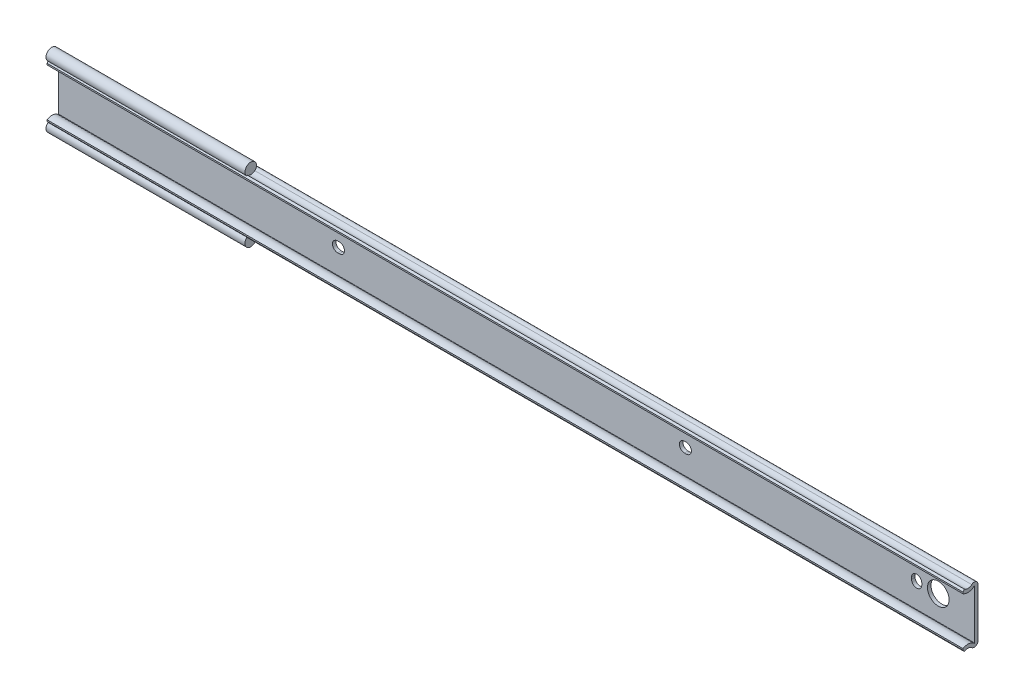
ISO-10303-21;
HEADER;
FILE_DESCRIPTION(('STEP AP214'),'2;1');
FILE_NAME('part.step','',(''),(''),'','','');
FILE_SCHEMA(('AUTOMOTIVE_DESIGN { 1 0 10303 214 1 1 1 1 }'));
ENDSEC;
DATA;
#1=APPLICATION_CONTEXT('core data for automotive mechanical design processes');
#2=APPLICATION_PROTOCOL_DEFINITION('international standard','automotive_design',2000,#1);
#3=PRODUCT_CONTEXT('',#1,'mechanical');
#4=PRODUCT('Part','Part','',(#3));
#5=PRODUCT_RELATED_PRODUCT_CATEGORY('part','',(#4));
#6=PRODUCT_DEFINITION_FORMATION('','',#4);
#7=PRODUCT_DEFINITION_CONTEXT('part definition',#1,'design');
#8=PRODUCT_DEFINITION('design','',#6,#7);
#9=PRODUCT_DEFINITION_SHAPE('','',#8);
#10=(LENGTH_UNIT() NAMED_UNIT(*) SI_UNIT(.MILLI.,.METRE.));
#11=(NAMED_UNIT(*) PLANE_ANGLE_UNIT() SI_UNIT($,.RADIAN.));
#12=(NAMED_UNIT(*) SI_UNIT($,.STERADIAN.) SOLID_ANGLE_UNIT());
#13=UNCERTAINTY_MEASURE_WITH_UNIT(LENGTH_MEASURE(1.E-05),#10,'distance_accuracy_value','');
#14=(GEOMETRIC_REPRESENTATION_CONTEXT(3) GLOBAL_UNCERTAINTY_ASSIGNED_CONTEXT((#13)) GLOBAL_UNIT_ASSIGNED_CONTEXT((#10,
#11,#12)) REPRESENTATION_CONTEXT('',''));
#15=CARTESIAN_POINT('',(0.,0.,0.));
#16=DIRECTION('',(0.,0.,1.));
#17=DIRECTION('',(1.,0.,0.));
#18=AXIS2_PLACEMENT_3D('',#15,#16,#17);
#19=CARTESIAN_POINT('',(-173.8,-13.9149976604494,4.44999754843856));
#20=DIRECTION('',(1.,0.,0.));
#21=DIRECTION('',(0.,0.,-1.));
#22=AXIS2_PLACEMENT_3D('',#19,#20,#21);
#23=CYLINDRICAL_SURFACE('',#22,2.55000000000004);
#24=DIRECTION('',(1.,0.,0.));
#25=VECTOR('',#24,1.);
#26=CARTESIAN_POINT('',(-173.8,-11.8784773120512,5.98462612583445));
#27=LINE('',#26,#25);
#28=CARTESIAN_POINT('',(-86.4,-11.8784773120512,5.98462612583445));
#29=VERTEX_POINT('',#28);
#30=CARTESIAN_POINT('',(228.6,-11.8784773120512,5.98462612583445));
#31=VERTEX_POINT('',#30);
#32=EDGE_CURVE('E390',#29,#31,#27,.T.);
#33=ORIENTED_EDGE('',*,*,#32,.F.);
#34=CARTESIAN_POINT('',(-86.4,-13.9149976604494,4.44999754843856));
#35=DIRECTION('',(-1.,0.,0.));
#36=DIRECTION('',(0.,0.,1.));
#37=AXIS2_PLACEMENT_3D('',#34,#35,#36);
#38=CIRCLE('',#37,2.55000000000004);
#39=CARTESIAN_POINT('',(-86.4,-12.0036867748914,2.76198371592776));
#40=VERTEX_POINT('',#39);
#41=EDGE_CURVE('E301',#29,#40,#38,.T.);
#42=ORIENTED_EDGE('',*,*,#41,.T.);
#43=DIRECTION('',(1.,0.,0.));
#44=VECTOR('',#43,1.);
#45=CARTESIAN_POINT('',(-173.8,-12.0036867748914,2.76198371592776));
#46=LINE('',#45,#44);
#47=CARTESIAN_POINT('',(228.6,-12.0036867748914,2.76198371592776));
#48=VERTEX_POINT('',#47);
#49=EDGE_CURVE('E388',#40,#48,#46,.T.);
#50=ORIENTED_EDGE('',*,*,#49,.T.);
#51=CARTESIAN_POINT('',(228.6,-13.9149976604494,4.44999754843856));
#52=DIRECTION('',(-1.,0.,0.));
#53=DIRECTION('',(0.,0.,1.));
#54=AXIS2_PLACEMENT_3D('',#51,#52,#53);
#55=CIRCLE('',#54,2.55000000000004);
#56=EDGE_CURVE('E343',#31,#48,#55,.T.);
#57=ORIENTED_EDGE('',*,*,#56,.F.);
#58=EDGE_LOOP('',(#33,#42,#50,#57));
#59=FACE_BOUND('',#58,.T.);
#60=ADVANCED_FACE('F14',(#59),#23,.F.);
#61=CARTESIAN_POINT('',(-173.8,-10.7622239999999,0.));
#62=DIRECTION('',(0.,0.,-1.));
#63=DIRECTION('',(-1.,0.,0.));
#64=AXIS2_PLACEMENT_3D('',#61,#62,#63);
#65=PLANE('',#64);
#66=CARTESIAN_POINT('',(-51.2,0.,0.));
#67=DIRECTION('',(0.,0.,-1.));
#68=DIRECTION('',(-1.,0.,0.));
#69=AXIS2_PLACEMENT_3D('',#66,#67,#68);
#70=CIRCLE('',#69,2.25);
#71=CARTESIAN_POINT('',(-51.2,-2.25,0.));
#72=VERTEX_POINT('',#71);
#73=CARTESIAN_POINT('',(-51.2,2.25,0.));
#74=VERTEX_POINT('',#73);
#75=EDGE_CURVE('E29',#72,#74,#70,.T.);
#76=ORIENTED_EDGE('',*,*,#75,.F.);
#77=DIRECTION('',(-1.,0.,0.));
#78=VECTOR('',#77,1.);
#79=CARTESIAN_POINT('',(-50.4,-2.25,0.));
#80=LINE('',#79,#78);
#81=CARTESIAN_POINT('',(-50.4,-2.25,0.));
#82=VERTEX_POINT('',#81);
#83=EDGE_CURVE('E229',#82,#72,#80,.T.);
#84=ORIENTED_EDGE('',*,*,#83,.F.);
#85=CARTESIAN_POINT('',(-50.4,0.,0.));
#86=DIRECTION('',(0.,0.,-1.));
#87=DIRECTION('',(-1.,0.,0.));
#88=AXIS2_PLACEMENT_3D('',#85,#86,#87);
#89=CIRCLE('',#88,2.25);
#90=CARTESIAN_POINT('',(-50.4,2.25,0.));
#91=VERTEX_POINT('',#90);
#92=EDGE_CURVE('E213',#91,#82,#89,.T.);
#93=ORIENTED_EDGE('',*,*,#92,.F.);
#94=DIRECTION('',(1.,0.,0.));
#95=VECTOR('',#94,1.);
#96=CARTESIAN_POINT('',(-51.2,2.25,0.));
#97=LINE('',#96,#95);
#98=EDGE_CURVE('E222',#74,#91,#97,.T.);
#99=ORIENTED_EDGE('',*,*,#98,.F.);
#100=EDGE_LOOP('',(#76,#84,#93,#99));
#101=FACE_BOUND('',#100,.T.);
#102=CARTESIAN_POINT('',(212.7,1.48762702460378E-13,0.));
#103=DIRECTION('',(0.,0.,-1.));
#104=DIRECTION('',(-1.,0.,0.));
#105=AXIS2_PLACEMENT_3D('',#102,#103,#104);
#106=CIRCLE('',#105,4.75);
#107=CARTESIAN_POINT('',(207.95,1.48762702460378E-13,0.));
#108=VERTEX_POINT('',#107);
#109=EDGE_CURVE('E239',#108,#108,#106,.T.);
#110=ORIENTED_EDGE('',*,*,#109,.F.);
#111=EDGE_LOOP('',(#110));
#112=FACE_BOUND('',#111,.T.);
#113=CARTESIAN_POINT('',(203.2,0.400000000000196,0.));
#114=DIRECTION('',(0.,0.,-1.));
#115=DIRECTION('',(-1.,0.,0.));
#116=AXIS2_PLACEMENT_3D('',#113,#114,#115);
#117=CIRCLE('',#116,2.24999999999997);
#118=CARTESIAN_POINT('',(200.95,0.400000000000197,0.));
#119=VERTEX_POINT('',#118);
#120=CARTESIAN_POINT('',(205.45,0.400000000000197,0.));
#121=VERTEX_POINT('',#120);
#122=EDGE_CURVE('E244',#119,#121,#117,.T.);
#123=ORIENTED_EDGE('',*,*,#122,.F.);
#124=DIRECTION('',(0.,1.,0.));
#125=VECTOR('',#124,1.);
#126=CARTESIAN_POINT('',(200.95,0.400000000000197,0.));
#127=LINE('',#126,#125);
#128=CARTESIAN_POINT('',(200.95,-0.399999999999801,0.));
#129=VERTEX_POINT('',#128);
#130=EDGE_CURVE('E253',#129,#119,#127,.T.);
#131=ORIENTED_EDGE('',*,*,#130,.F.);
#132=CARTESIAN_POINT('',(203.2,-0.3999999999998,0.));
#133=DIRECTION('',(0.,0.,-1.));
#134=DIRECTION('',(-1.,0.,0.));
#135=AXIS2_PLACEMENT_3D('',#132,#133,#134);
#136=CIRCLE('',#135,2.24999999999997);
#137=CARTESIAN_POINT('',(205.45,-0.399999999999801,0.));
#138=VERTEX_POINT('',#137);
#139=EDGE_CURVE('E250',#138,#129,#136,.T.);
#140=ORIENTED_EDGE('',*,*,#139,.F.);
#141=DIRECTION('',(0.,-1.,0.));
#142=VECTOR('',#141,1.);
#143=CARTESIAN_POINT('',(205.45,0.400000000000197,0.));
#144=LINE('',#143,#142);
#145=EDGE_CURVE('E246',#121,#138,#144,.T.);
#146=ORIENTED_EDGE('',*,*,#145,.F.);
#147=EDGE_LOOP('',(#123,#131,#140,#146));
#148=FACE_BOUND('',#147,.T.);
#149=CARTESIAN_POINT('',(102.,2.88714991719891E-13,0.));
#150=DIRECTION('',(0.,0.,-1.));
#151=DIRECTION('',(-1.,0.,0.));
#152=AXIS2_PLACEMENT_3D('',#149,#150,#151);
#153=CIRCLE('',#152,2.25000000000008);
#154=CARTESIAN_POINT('',(102.,2.25000000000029,0.));
#155=VERTEX_POINT('',#154);
#156=CARTESIAN_POINT('',(102.,-2.24999999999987,0.));
#157=VERTEX_POINT('',#156);
#158=EDGE_CURVE('E236',#155,#157,#153,.T.);
#159=ORIENTED_EDGE('',*,*,#158,.F.);
#160=DIRECTION('',(1.,0.,0.));
#161=VECTOR('',#160,1.);
#162=CARTESIAN_POINT('',(102.,2.25000000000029,0.));
#163=LINE('',#162,#161);
#164=CARTESIAN_POINT('',(101.2,2.25000000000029,0.));
#165=VERTEX_POINT('',#164);
#166=EDGE_CURVE('E271',#165,#155,#163,.T.);
#167=ORIENTED_EDGE('',*,*,#166,.F.);
#168=CARTESIAN_POINT('',(101.2,2.88568031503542E-13,0.));
#169=DIRECTION('',(0.,0.,-1.));
#170=DIRECTION('',(-1.,0.,0.));
#171=AXIS2_PLACEMENT_3D('',#168,#169,#170);
#172=CIRCLE('',#171,2.25000000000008);
#173=CARTESIAN_POINT('',(101.2,-2.24999999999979,0.));
#174=VERTEX_POINT('',#173);
#175=EDGE_CURVE('E268',#174,#165,#172,.T.);
#176=ORIENTED_EDGE('',*,*,#175,.F.);
#177=DIRECTION('',(-1.,0.,0.));
#178=VECTOR('',#177,1.);
#179=CARTESIAN_POINT('',(102.,-2.24999999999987,0.));
#180=LINE('',#179,#178);
#181=EDGE_CURVE('E265',#157,#174,#180,.T.);
#182=ORIENTED_EDGE('',*,*,#181,.F.);
#183=EDGE_LOOP('',(#159,#167,#176,#182));
#184=FACE_BOUND('',#183,.T.);
#185=DIRECTION('',(0.,1.,0.));
#186=VECTOR('',#185,1.);
#187=CARTESIAN_POINT('',(-173.8,-10.7622239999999,0.));
#188=LINE('',#187,#186);
#189=CARTESIAN_POINT('',(-173.8,-10.7622239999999,0.));
#190=VERTEX_POINT('',#189);
#191=CARTESIAN_POINT('',(-173.8,10.7622240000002,0.));
#192=VERTEX_POINT('',#191);
#193=EDGE_CURVE('E379',#190,#192,#188,.T.);
#194=ORIENTED_EDGE('',*,*,#193,.T.);
#195=DIRECTION('',(1.,0.,0.));
#196=VECTOR('',#195,1.);
#197=CARTESIAN_POINT('',(-173.8,10.7622240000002,0.));
#198=LINE('',#197,#196);
#199=CARTESIAN_POINT('',(228.6,10.7622240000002,0.));
#200=VERTEX_POINT('',#199);
#201=EDGE_CURVE('E382',#192,#200,#198,.T.);
#202=ORIENTED_EDGE('',*,*,#201,.T.);
#203=DIRECTION('',(0.,1.,0.));
#204=VECTOR('',#203,1.);
#205=CARTESIAN_POINT('',(228.6,-10.7622239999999,0.));
#206=LINE('',#205,#204);
#207=CARTESIAN_POINT('',(228.6,-10.7622239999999,0.));
#208=VERTEX_POINT('',#207);
#209=EDGE_CURVE('E348',#208,#200,#206,.T.);
#210=ORIENTED_EDGE('',*,*,#209,.F.);
#211=DIRECTION('',(1.,0.,0.));
#212=VECTOR('',#211,1.);
#213=CARTESIAN_POINT('',(-173.8,-10.7622239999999,0.));
#214=LINE('',#213,#212);
#215=EDGE_CURVE('E385',#190,#208,#214,.T.);
#216=ORIENTED_EDGE('',*,*,#215,.F.);
#217=EDGE_LOOP('',(#194,#202,#210,#216));
#218=FACE_BOUND('',#217,.T.);
#219=ADVANCED_FACE('F226',(#101,#112,#148,#184,#218),#65,.T.);
#220=CARTESIAN_POINT('',(-173.8,-10.7845049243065,1.54999983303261));
#221=DIRECTION('',(0.,0.,1.));
#222=DIRECTION('',(0.,-1.,0.));
#223=AXIS2_PLACEMENT_3D('',#220,#221,#222);
#224=PLANE('',#223);
#225=CARTESIAN_POINT('',(-51.2,0.,1.54999983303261));
#226=DIRECTION('',(0.,0.,1.));
#227=DIRECTION('',(0.,-1.,0.));
#228=AXIS2_PLACEMENT_3D('',#225,#226,#227);
#229=CIRCLE('',#228,2.25);
#230=CARTESIAN_POINT('',(-51.2,2.25,1.54999983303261));
#231=VERTEX_POINT('',#230);
#232=CARTESIAN_POINT('',(-51.2,-2.25,1.54999983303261));
#233=VERTEX_POINT('',#232);
#234=EDGE_CURVE('E9',#231,#233,#229,.T.);
#235=ORIENTED_EDGE('',*,*,#234,.F.);
#236=DIRECTION('',(-1.,0.,0.));
#237=VECTOR('',#236,1.);
#238=CARTESIAN_POINT('',(-173.8,2.25,1.54999983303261));
#239=LINE('',#238,#237);
#240=CARTESIAN_POINT('',(-50.4,2.25,1.54999983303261));
#241=VERTEX_POINT('',#240);
#242=EDGE_CURVE('E439',#241,#231,#239,.T.);
#243=ORIENTED_EDGE('',*,*,#242,.F.);
#244=CARTESIAN_POINT('',(-50.4,0.,1.54999983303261));
#245=DIRECTION('',(0.,0.,1.));
#246=DIRECTION('',(0.,-1.,0.));
#247=AXIS2_PLACEMENT_3D('',#244,#245,#246);
#248=CIRCLE('',#247,2.25);
#249=CARTESIAN_POINT('',(-50.4,-2.25,1.54999983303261));
#250=VERTEX_POINT('',#249);
#251=EDGE_CURVE('E216',#250,#241,#248,.T.);
#252=ORIENTED_EDGE('',*,*,#251,.F.);
#253=DIRECTION('',(1.,0.,0.));
#254=VECTOR('',#253,1.);
#255=CARTESIAN_POINT('',(-173.8,-2.25,1.54999983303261));
#256=LINE('',#255,#254);
#257=EDGE_CURVE('E22',#233,#250,#256,.T.);
#258=ORIENTED_EDGE('',*,*,#257,.F.);
#259=EDGE_LOOP('',(#235,#243,#252,#258));
#260=FACE_BOUND('',#259,.T.);
#261=CARTESIAN_POINT('',(212.7,1.48762702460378E-13,1.54999983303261));
#262=DIRECTION('',(0.,0.,1.));
#263=DIRECTION('',(0.,-1.,0.));
#264=AXIS2_PLACEMENT_3D('',#261,#262,#263);
#265=CIRCLE('',#264,4.75);
#266=CARTESIAN_POINT('',(212.7,-4.74999999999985,1.54999983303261));
#267=VERTEX_POINT('',#266);
#268=EDGE_CURVE('E242',#267,#267,#265,.T.);
#269=ORIENTED_EDGE('',*,*,#268,.F.);
#270=EDGE_LOOP('',(#269));
#271=FACE_BOUND('',#270,.T.);
#272=CARTESIAN_POINT('',(203.2,0.400000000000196,1.54999983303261));
#273=DIRECTION('',(0.,0.,1.));
#274=DIRECTION('',(0.,-1.,0.));
#275=AXIS2_PLACEMENT_3D('',#272,#273,#274);
#276=CIRCLE('',#275,2.24999999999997);
#277=CARTESIAN_POINT('',(205.45,0.400000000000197,1.54999983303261));
#278=VERTEX_POINT('',#277);
#279=CARTESIAN_POINT('',(200.95,0.400000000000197,1.54999983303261));
#280=VERTEX_POINT('',#279);
#281=EDGE_CURVE('E437',#278,#280,#276,.T.);
#282=ORIENTED_EDGE('',*,*,#281,.F.);
#283=DIRECTION('',(0.,1.,0.));
#284=VECTOR('',#283,1.);
#285=CARTESIAN_POINT('',(205.45,-10.7845049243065,1.54999983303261));
#286=LINE('',#285,#284);
#287=CARTESIAN_POINT('',(205.45,-0.399999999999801,1.54999983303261));
#288=VERTEX_POINT('',#287);
#289=EDGE_CURVE('E430',#288,#278,#286,.T.);
#290=ORIENTED_EDGE('',*,*,#289,.F.);
#291=CARTESIAN_POINT('',(203.2,-0.3999999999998,1.54999983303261));
#292=DIRECTION('',(0.,0.,1.));
#293=DIRECTION('',(0.,-1.,0.));
#294=AXIS2_PLACEMENT_3D('',#291,#292,#293);
#295=CIRCLE('',#294,2.24999999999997);
#296=CARTESIAN_POINT('',(200.95,-0.399999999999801,1.54999983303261));
#297=VERTEX_POINT('',#296);
#298=EDGE_CURVE('E432',#297,#288,#295,.T.);
#299=ORIENTED_EDGE('',*,*,#298,.F.);
#300=DIRECTION('',(0.,-1.,0.));
#301=VECTOR('',#300,1.);
#302=CARTESIAN_POINT('',(200.95,-10.7845049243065,1.54999983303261));
#303=LINE('',#302,#301);
#304=EDGE_CURVE('E435',#280,#297,#303,.T.);
#305=ORIENTED_EDGE('',*,*,#304,.F.);
#306=EDGE_LOOP('',(#282,#290,#299,#305));
#307=FACE_BOUND('',#306,.T.);
#308=CARTESIAN_POINT('',(102.,2.88714991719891E-13,1.54999983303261));
#309=DIRECTION('',(0.,0.,1.));
#310=DIRECTION('',(0.,-1.,0.));
#311=AXIS2_PLACEMENT_3D('',#308,#309,#310);
#312=CIRCLE('',#311,2.25000000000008);
#313=CARTESIAN_POINT('',(102.,-2.24999999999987,1.54999983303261));
#314=VERTEX_POINT('',#313);
#315=CARTESIAN_POINT('',(102.,2.25000000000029,1.54999983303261));
#316=VERTEX_POINT('',#315);
#317=EDGE_CURVE('E428',#314,#316,#312,.T.);
#318=ORIENTED_EDGE('',*,*,#317,.F.);
#319=DIRECTION('',(1.,0.,0.));
#320=VECTOR('',#319,1.);
#321=CARTESIAN_POINT('',(-173.8,-2.24999999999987,1.54999983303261));
#322=LINE('',#321,#320);
#323=CARTESIAN_POINT('',(101.2,-2.24999999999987,1.54999983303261));
#324=VERTEX_POINT('',#323);
#325=EDGE_CURVE('E421',#324,#314,#322,.T.);
#326=ORIENTED_EDGE('',*,*,#325,.F.);
#327=CARTESIAN_POINT('',(101.2,2.88568031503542E-13,1.54999983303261));
#328=DIRECTION('',(0.,0.,1.));
#329=DIRECTION('',(0.,-1.,0.));
#330=AXIS2_PLACEMENT_3D('',#327,#328,#329);
#331=CIRCLE('',#330,2.25000000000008);
#332=CARTESIAN_POINT('',(101.2,2.25000000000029,1.54999983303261));
#333=VERTEX_POINT('',#332);
#334=EDGE_CURVE('E423',#333,#324,#331,.T.);
#335=ORIENTED_EDGE('',*,*,#334,.F.);
#336=DIRECTION('',(-1.,0.,0.));
#337=VECTOR('',#336,1.);
#338=CARTESIAN_POINT('',(-173.8,2.25000000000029,1.54999983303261));
#339=LINE('',#338,#337);
#340=EDGE_CURVE('E426',#316,#333,#339,.T.);
#341=ORIENTED_EDGE('',*,*,#340,.F.);
#342=EDGE_LOOP('',(#318,#326,#335,#341));
#343=FACE_BOUND('',#342,.T.);
#344=DIRECTION('',(0.,-1.,0.));
#345=VECTOR('',#344,1.);
#346=CARTESIAN_POINT('',(-173.8,-10.7845049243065,1.54999983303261));
#347=LINE('',#346,#345);
#348=CARTESIAN_POINT('',(-173.8,10.7845049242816,1.54999983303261));
#349=VERTEX_POINT('',#348);
#350=CARTESIAN_POINT('',(-173.8,-10.7845049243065,1.54999983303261));
#351=VERTEX_POINT('',#350);
#352=EDGE_CURVE('E364',#349,#351,#347,.T.);
#353=ORIENTED_EDGE('',*,*,#352,.T.);
#354=DIRECTION('',(1.,0.,0.));
#355=VECTOR('',#354,1.);
#356=CARTESIAN_POINT('',(-173.8,-10.7845049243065,1.54999983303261));
#357=LINE('',#356,#355);
#358=CARTESIAN_POINT('',(228.6,-10.7845049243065,1.54999983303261));
#359=VERTEX_POINT('',#358);
#360=EDGE_CURVE('E398',#351,#359,#357,.T.);
#361=ORIENTED_EDGE('',*,*,#360,.T.);
#362=DIRECTION('',(0.,-1.,0.));
#363=VECTOR('',#362,1.);
#364=CARTESIAN_POINT('',(228.6,-10.7845049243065,1.54999983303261));
#365=LINE('',#364,#363);
#366=CARTESIAN_POINT('',(228.6,10.7845049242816,1.54999983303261));
#367=VERTEX_POINT('',#366);
#368=EDGE_CURVE('E328',#367,#359,#365,.T.);
#369=ORIENTED_EDGE('',*,*,#368,.F.);
#370=DIRECTION('',(1.,0.,0.));
#371=VECTOR('',#370,1.);
#372=CARTESIAN_POINT('',(-173.8,10.7845049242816,1.54999983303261));
#373=LINE('',#372,#371);
#374=EDGE_CURVE('E400',#349,#367,#373,.T.);
#375=ORIENTED_EDGE('',*,*,#374,.F.);
#376=EDGE_LOOP('',(#353,#361,#369,#375));
#377=FACE_BOUND('',#376,.T.);
#378=ADVANCED_FACE('F449',(#260,#271,#307,#343,#377),#224,.T.);
#379=CARTESIAN_POINT('',(-173.8,10.7622240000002,1.65999962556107));
#380=DIRECTION('',(1.,0.,0.));
#381=DIRECTION('',(0.,0.,-1.));
#382=AXIS2_PLACEMENT_3D('',#379,#380,#381);
#383=PLANE('',#382);
#384=DIRECTION('',(0.,-0.798635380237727,0.601815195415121));
#385=VECTOR('',#384,1.);
#386=CARTESIAN_POINT('',(-173.8,11.8784794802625,5.98462807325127));
#387=LINE('',#386,#385);
#388=CARTESIAN_POINT('',(-173.8,11.6418409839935,6.16294805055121));
#389=VERTEX_POINT('',#388);
#390=CARTESIAN_POINT('',(-173.8,11.0618541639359,6.59999966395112));
#391=VERTEX_POINT('',#390);
#392=EDGE_CURVE('E353',#389,#391,#387,.T.);
#393=ORIENTED_EDGE('',*,*,#392,.F.);
#394=CARTESIAN_POINT('',(-173.8,13.5750000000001,4.5));
#395=DIRECTION('',(-1.,0.,0.));
#396=DIRECTION('',(0.,0.,-1.));
#397=AXIS2_PLACEMENT_3D('',#394,#395,#396);
#398=CIRCLE('',#397,2.55);
#399=CARTESIAN_POINT('',(-173.8,12.2965303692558,2.29364205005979));
#400=VERTEX_POINT('',#399);
#401=EDGE_CURVE('E286',#389,#400,#398,.T.);
#402=ORIENTED_EDGE('',*,*,#401,.T.);
#403=CARTESIAN_POINT('',(-173.8,10.7622240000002,1.65999962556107));
#404=DIRECTION('',(1.,0.,0.));
#405=DIRECTION('',(0.,0.,-1.));
#406=AXIS2_PLACEMENT_3D('',#403,#404,#405);
#407=CIRCLE('',#406,1.65999962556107);
#408=EDGE_CURVE('E351',#192,#400,#407,.T.);
#409=ORIENTED_EDGE('',*,*,#408,.F.);
#410=ORIENTED_EDGE('',*,*,#193,.F.);
#411=CARTESIAN_POINT('',(-173.8,-10.7622239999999,1.65999962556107));
#412=DIRECTION('',(1.,0.,0.));
#413=DIRECTION('',(0.,0.,1.));
#414=AXIS2_PLACEMENT_3D('',#411,#412,#413);
#415=CIRCLE('',#414,1.65999962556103);
#416=CARTESIAN_POINT('',(-173.8,-12.2965303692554,2.29364205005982));
#417=VERTEX_POINT('',#416);
#418=EDGE_CURVE('E377',#417,#190,#415,.T.);
#419=ORIENTED_EDGE('',*,*,#418,.F.);
#420=CARTESIAN_POINT('',(-173.8,-13.5749999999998,4.5));
#421=DIRECTION('',(-1.,0.,0.));
#422=DIRECTION('',(0.,0.,1.));
#423=AXIS2_PLACEMENT_3D('',#420,#421,#422);
#424=CIRCLE('',#423,2.55);
#425=CARTESIAN_POINT('',(-173.8,-11.6418391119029,6.16294587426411));
#426=VERTEX_POINT('',#425);
#427=EDGE_CURVE('E297',#417,#426,#424,.T.);
#428=ORIENTED_EDGE('',*,*,#427,.T.);
#429=DIRECTION('',(0.,-0.798635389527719,-0.601815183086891));
#430=VECTOR('',#429,1.);
#431=CARTESIAN_POINT('',(-173.8,-11.8784773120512,5.98462612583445));
#432=LINE('',#431,#430);
#433=CARTESIAN_POINT('',(-173.8,-11.0618545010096,6.59999580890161));
#434=VERTEX_POINT('',#433);
#435=EDGE_CURVE('E375',#434,#426,#432,.T.);
#436=ORIENTED_EDGE('',*,*,#435,.F.);
#437=DIRECTION('',(0.,-1.,0.));
#438=VECTOR('',#437,1.);
#439=CARTESIAN_POINT('',(-173.8,-11.0618545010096,6.59999580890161));
#440=LINE('',#439,#438);
#441=CARTESIAN_POINT('',(-173.8,-10.4239404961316,6.59999580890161));
#442=VERTEX_POINT('',#441);
#443=EDGE_CURVE('E372',#442,#434,#440,.T.);
#444=ORIENTED_EDGE('',*,*,#443,.F.);
#445=CARTESIAN_POINT('',(-173.8,-13.9149976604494,4.44999754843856));
#446=DIRECTION('',(1.,0.,0.));
#447=DIRECTION('',(0.,0.,1.));
#448=AXIS2_PLACEMENT_3D('',#445,#446,#447);
#449=CIRCLE('',#448,4.09999666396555);
#450=CARTESIAN_POINT('',(-173.8,-10.8590405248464,1.71666649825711));
#451=VERTEX_POINT('',#450);
#452=EDGE_CURVE('E369',#451,#442,#449,.T.);
#453=ORIENTED_EDGE('',*,*,#452,.F.);
#454=CARTESIAN_POINT('',(-173.8,-10.7845049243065,1.64999983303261));
#455=DIRECTION('',(-1.,0.,0.));
#456=DIRECTION('',(0.,0.,-1.));
#457=AXIS2_PLACEMENT_3D('',#454,#455,#456);
#458=CIRCLE('',#457,0.1);
#459=EDGE_CURVE('E366',#351,#451,#458,.T.);
#460=ORIENTED_EDGE('',*,*,#459,.F.);
#461=ORIENTED_EDGE('',*,*,#352,.F.);
#462=CARTESIAN_POINT('',(-173.8,10.7845049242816,1.64999983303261));
#463=DIRECTION('',(-1.,0.,0.));
#464=DIRECTION('',(0.,0.,1.));
#465=AXIS2_PLACEMENT_3D('',#462,#463,#464);
#466=CIRCLE('',#465,0.1);
#467=CARTESIAN_POINT('',(-173.8,10.8590405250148,1.71666649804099));
#468=VERTEX_POINT('',#467);
#469=EDGE_CURVE('E361',#468,#349,#466,.T.);
#470=ORIENTED_EDGE('',*,*,#469,.F.);
#471=CARTESIAN_POINT('',(-173.8,13.9150000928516,4.44999970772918));
#472=DIRECTION('',(1.,0.,0.));
#473=DIRECTION('',(0.,0.,-1.));
#474=AXIS2_PLACEMENT_3D('',#471,#472,#473);
#475=CIRCLE('',#474,4.09999991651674);
#476=CARTESIAN_POINT('',(-173.8,10.4239401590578,6.59999967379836));
#477=VERTEX_POINT('',#476);
#478=EDGE_CURVE('E358',#477,#468,#475,.T.);
#479=ORIENTED_EDGE('',*,*,#478,.F.);
#480=DIRECTION('',(0.,-1.,1.54366169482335E-08));
#481=VECTOR('',#480,1.);
#482=CARTESIAN_POINT('',(-173.8,11.0618541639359,6.59999966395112));
#483=LINE('',#482,#481);
#484=EDGE_CURVE('E355',#391,#477,#483,.T.);
#485=ORIENTED_EDGE('',*,*,#484,.F.);
#486=EDGE_LOOP('',(#393,#402,#409,#410,#419,#428,#436,#444,#453,#460,#461,#470,#479,#485));
#487=FACE_BOUND('',#486,.T.);
#488=ADVANCED_FACE('F497',(#487),#383,.F.);
#489=CARTESIAN_POINT('',(-173.8,10.7622240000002,1.65999962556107));
#490=DIRECTION('',(1.,0.,0.));
#491=DIRECTION('',(0.,0.,-1.));
#492=AXIS2_PLACEMENT_3D('',#489,#490,#491);
#493=CYLINDRICAL_SURFACE('',#492,1.65999962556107);
#494=DIRECTION('',(-1.,0.,0.));
#495=VECTOR('',#494,1.);
#496=CARTESIAN_POINT('',(-130.1,12.2965303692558,2.29364205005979));
#497=LINE('',#496,#495);
#498=CARTESIAN_POINT('',(-86.4,12.2965303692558,2.29364205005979));
#499=VERTEX_POINT('',#498);
#500=EDGE_CURVE('E294',#499,#400,#497,.T.);
#501=ORIENTED_EDGE('',*,*,#500,.F.);
#502=CARTESIAN_POINT('',(-86.4,10.7622240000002,1.65999962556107));
#503=DIRECTION('',(1.,0.,0.));
#504=DIRECTION('',(0.,0.,-1.));
#505=AXIS2_PLACEMENT_3D('',#502,#503,#504);
#506=CIRCLE('',#505,1.65999962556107);
#507=CARTESIAN_POINT('',(-86.4,12.0053612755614,2.76009438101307));
#508=VERTEX_POINT('',#507);
#509=EDGE_CURVE('E291',#508,#499,#506,.F.);
#510=ORIENTED_EDGE('',*,*,#509,.F.);
#511=DIRECTION('',(1.,0.,0.));
#512=VECTOR('',#511,1.);
#513=CARTESIAN_POINT('',(-173.8,12.0053612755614,2.76009438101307));
#514=LINE('',#513,#512);
#515=CARTESIAN_POINT('',(228.6,12.0053612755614,2.76009438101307));
#516=VERTEX_POINT('',#515);
#517=EDGE_CURVE('E381',#508,#516,#514,.T.);
#518=ORIENTED_EDGE('',*,*,#517,.T.);
#519=CARTESIAN_POINT('',(228.6,10.7622240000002,1.65999962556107));
#520=DIRECTION('',(1.,0.,0.));
#521=DIRECTION('',(0.,0.,-1.));
#522=AXIS2_PLACEMENT_3D('',#519,#520,#521);
#523=CIRCLE('',#522,1.65999962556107);
#524=EDGE_CURVE('E310',#200,#516,#523,.T.);
#525=ORIENTED_EDGE('',*,*,#524,.F.);
#526=ORIENTED_EDGE('',*,*,#201,.F.);
#527=ORIENTED_EDGE('',*,*,#408,.T.);
#528=EDGE_LOOP('',(#501,#510,#518,#525,#526,#527));
#529=FACE_BOUND('',#528,.T.);
#530=ADVANCED_FACE('F16',(#529),#493,.T.);
#531=CARTESIAN_POINT('',(-173.8,-10.7622239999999,1.65999962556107));
#532=DIRECTION('',(1.,0.,0.));
#533=DIRECTION('',(0.,0.,-1.));
#534=AXIS2_PLACEMENT_3D('',#531,#532,#533);
#535=CYLINDRICAL_SURFACE('',#534,1.65999962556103);
#536=DIRECTION('',(-1.,0.,0.));
#537=VECTOR('',#536,1.);
#538=CARTESIAN_POINT('',(-130.1,-12.2965303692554,2.29364205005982));
#539=LINE('',#538,#537);
#540=CARTESIAN_POINT('',(-86.4,-12.2965303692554,2.29364205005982));
#541=VERTEX_POINT('',#540);
#542=EDGE_CURVE('E307',#417,#541,#539,.F.);
#543=ORIENTED_EDGE('',*,*,#542,.F.);
#544=ORIENTED_EDGE('',*,*,#418,.T.);
#545=ORIENTED_EDGE('',*,*,#215,.T.);
#546=CARTESIAN_POINT('',(228.6,-10.7622239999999,1.65999962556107));
#547=DIRECTION('',(1.,0.,0.));
#548=DIRECTION('',(0.,0.,1.));
#549=AXIS2_PLACEMENT_3D('',#546,#547,#548);
#550=CIRCLE('',#549,1.65999962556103);
#551=EDGE_CURVE('E346',#48,#208,#550,.T.);
#552=ORIENTED_EDGE('',*,*,#551,.F.);
#553=ORIENTED_EDGE('',*,*,#49,.F.);
#554=CARTESIAN_POINT('',(-86.4,-10.7622239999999,1.65999962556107));
#555=DIRECTION('',(-1.,0.,0.));
#556=DIRECTION('',(0.,0.,1.));
#557=AXIS2_PLACEMENT_3D('',#554,#555,#556);
#558=CIRCLE('',#557,1.65999962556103);
#559=EDGE_CURVE('E305',#40,#541,#558,.F.);
#560=ORIENTED_EDGE('',*,*,#559,.T.);
#561=EDGE_LOOP('',(#543,#544,#545,#552,#553,#560));
#562=FACE_BOUND('',#561,.T.);
#563=ADVANCED_FACE('F477',(#562),#535,.T.);
#564=CARTESIAN_POINT('',(-173.8,-11.8784773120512,5.98462612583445));
#565=DIRECTION('',(0.,-0.601815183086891,0.798635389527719));
#566=DIRECTION('',(0.,-0.798635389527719,-0.601815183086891));
#567=AXIS2_PLACEMENT_3D('',#564,#565,#566);
#568=PLANE('',#567);
#569=DIRECTION('',(-1.,0.,0.));
#570=VECTOR('',#569,1.);
#571=CARTESIAN_POINT('',(-86.4,-11.6418391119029,6.16294587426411));
#572=LINE('',#571,#570);
#573=CARTESIAN_POINT('',(-86.4,-11.6418391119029,6.16294587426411));
#574=VERTEX_POINT('',#573);
#575=EDGE_CURVE('E412',#574,#426,#572,.T.);
#576=ORIENTED_EDGE('',*,*,#575,.F.);
#577=DIRECTION('',(0.,-0.798635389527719,-0.601815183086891));
#578=VECTOR('',#577,1.);
#579=CARTESIAN_POINT('',(-86.4,-11.8784773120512,5.98462612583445));
#580=LINE('',#579,#578);
#581=EDGE_CURVE('E384',#574,#29,#580,.T.);
#582=ORIENTED_EDGE('',*,*,#581,.T.);
#583=ORIENTED_EDGE('',*,*,#32,.T.);
#584=DIRECTION('',(0.,-0.798635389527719,-0.601815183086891));
#585=VECTOR('',#584,1.);
#586=CARTESIAN_POINT('',(228.6,-11.8784773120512,5.98462612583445));
#587=LINE('',#586,#585);
#588=CARTESIAN_POINT('',(228.6,-11.0618545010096,6.59999580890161));
#589=VERTEX_POINT('',#588);
#590=EDGE_CURVE('E340',#589,#31,#587,.T.);
#591=ORIENTED_EDGE('',*,*,#590,.F.);
#592=DIRECTION('',(1.,0.,0.));
#593=VECTOR('',#592,1.);
#594=CARTESIAN_POINT('',(-173.8,-11.0618545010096,6.59999580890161));
#595=LINE('',#594,#593);
#596=EDGE_CURVE('E392',#434,#589,#595,.T.);
#597=ORIENTED_EDGE('',*,*,#596,.F.);
#598=ORIENTED_EDGE('',*,*,#435,.T.);
#599=EDGE_LOOP('',(#576,#582,#583,#591,#597,#598));
#600=FACE_BOUND('',#599,.T.);
#601=ADVANCED_FACE('F478',(#600),#568,.T.);
#602=CARTESIAN_POINT('',(-173.8,-11.0618545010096,6.59999580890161));
#603=DIRECTION('',(0.,0.,1.));
#604=DIRECTION('',(1.,0.,0.));
#605=AXIS2_PLACEMENT_3D('',#602,#603,#604);
#606=PLANE('',#605);
#607=DIRECTION('',(0.,-1.,0.));
#608=VECTOR('',#607,1.);
#609=CARTESIAN_POINT('',(228.6,-11.0618545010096,6.59999580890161));
#610=LINE('',#609,#608);
#611=CARTESIAN_POINT('',(228.6,-10.4239404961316,6.59999580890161));
#612=VERTEX_POINT('',#611);
#613=EDGE_CURVE('E337',#612,#589,#610,.T.);
#614=ORIENTED_EDGE('',*,*,#613,.F.);
#615=DIRECTION('',(1.,0.,0.));
#616=VECTOR('',#615,1.);
#617=CARTESIAN_POINT('',(-173.8,-10.4239404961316,6.59999580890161));
#618=LINE('',#617,#616);
#619=EDGE_CURVE('E394',#442,#612,#618,.T.);
#620=ORIENTED_EDGE('',*,*,#619,.F.);
#621=ORIENTED_EDGE('',*,*,#443,.T.);
#622=ORIENTED_EDGE('',*,*,#596,.T.);
#623=EDGE_LOOP('',(#614,#620,#621,#622));
#624=FACE_BOUND('',#623,.T.);
#625=ADVANCED_FACE('F481',(#624),#606,.T.);
#626=CARTESIAN_POINT('',(-173.8,-13.9149976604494,4.44999754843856));
#627=DIRECTION('',(1.,0.,0.));
#628=DIRECTION('',(0.,0.,-1.));
#629=AXIS2_PLACEMENT_3D('',#626,#627,#628);
#630=CYLINDRICAL_SURFACE('',#629,4.09999666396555);
#631=CARTESIAN_POINT('',(228.6,-13.9149976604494,4.44999754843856));
#632=DIRECTION('',(1.,0.,0.));
#633=DIRECTION('',(0.,0.,1.));
#634=AXIS2_PLACEMENT_3D('',#631,#632,#633);
#635=CIRCLE('',#634,4.09999666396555);
#636=CARTESIAN_POINT('',(228.6,-10.8590405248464,1.71666649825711));
#637=VERTEX_POINT('',#636);
#638=EDGE_CURVE('E334',#637,#612,#635,.T.);
#639=ORIENTED_EDGE('',*,*,#638,.F.);
#640=DIRECTION('',(1.,0.,0.));
#641=VECTOR('',#640,1.);
#642=CARTESIAN_POINT('',(-173.8,-10.8590405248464,1.71666649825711));
#643=LINE('',#642,#641);
#644=EDGE_CURVE('E396',#451,#637,#643,.T.);
#645=ORIENTED_EDGE('',*,*,#644,.F.);
#646=ORIENTED_EDGE('',*,*,#452,.T.);
#647=ORIENTED_EDGE('',*,*,#619,.T.);
#648=EDGE_LOOP('',(#639,#645,#646,#647));
#649=FACE_BOUND('',#648,.T.);
#650=ADVANCED_FACE('F485',(#649),#630,.T.);
#651=CARTESIAN_POINT('',(-173.8,-10.7845049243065,1.64999983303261));
#652=DIRECTION('',(1.,0.,0.));
#653=DIRECTION('',(0.,0.,-1.));
#654=AXIS2_PLACEMENT_3D('',#651,#652,#653);
#655=CYLINDRICAL_SURFACE('',#654,0.1);
#656=CARTESIAN_POINT('',(228.6,-10.7845049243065,1.64999983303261));
#657=DIRECTION('',(-1.,0.,0.));
#658=DIRECTION('',(0.,0.,-1.));
#659=AXIS2_PLACEMENT_3D('',#656,#657,#658);
#660=CIRCLE('',#659,0.1);
#661=EDGE_CURVE('E331',#359,#637,#660,.T.);
#662=ORIENTED_EDGE('',*,*,#661,.F.);
#663=ORIENTED_EDGE('',*,*,#360,.F.);
#664=ORIENTED_EDGE('',*,*,#459,.T.);
#665=ORIENTED_EDGE('',*,*,#644,.T.);
#666=EDGE_LOOP('',(#662,#663,#664,#665));
#667=FACE_BOUND('',#666,.T.);
#668=ADVANCED_FACE('F489',(#667),#655,.F.);
#669=CARTESIAN_POINT('',(-173.8,10.7845049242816,1.64999983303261));
#670=DIRECTION('',(1.,0.,0.));
#671=DIRECTION('',(0.,0.,-1.));
#672=AXIS2_PLACEMENT_3D('',#669,#670,#671);
#673=CYLINDRICAL_SURFACE('',#672,0.1);
#674=CARTESIAN_POINT('',(228.6,10.7845049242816,1.64999983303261));
#675=DIRECTION('',(-1.,0.,0.));
#676=DIRECTION('',(0.,0.,1.));
#677=AXIS2_PLACEMENT_3D('',#674,#675,#676);
#678=CIRCLE('',#677,0.1);
#679=CARTESIAN_POINT('',(228.6,10.8590405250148,1.71666649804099));
#680=VERTEX_POINT('',#679);
#681=EDGE_CURVE('E325',#680,#367,#678,.T.);
#682=ORIENTED_EDGE('',*,*,#681,.F.);
#683=DIRECTION('',(1.,0.,0.));
#684=VECTOR('',#683,1.);
#685=CARTESIAN_POINT('',(-173.8,10.8590405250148,1.71666649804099));
#686=LINE('',#685,#684);
#687=EDGE_CURVE('E402',#468,#680,#686,.T.);
#688=ORIENTED_EDGE('',*,*,#687,.F.);
#689=ORIENTED_EDGE('',*,*,#469,.T.);
#690=ORIENTED_EDGE('',*,*,#374,.T.);
#691=EDGE_LOOP('',(#682,#688,#689,#690));
#692=FACE_BOUND('',#691,.T.);
#693=ADVANCED_FACE('F493',(#692),#673,.F.);
#694=CARTESIAN_POINT('',(-173.8,13.9150000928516,4.44999970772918));
#695=DIRECTION('',(1.,0.,0.));
#696=DIRECTION('',(0.,0.,-1.));
#697=AXIS2_PLACEMENT_3D('',#694,#695,#696);
#698=CYLINDRICAL_SURFACE('',#697,4.09999991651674);
#699=CARTESIAN_POINT('',(228.6,13.9150000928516,4.44999970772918));
#700=DIRECTION('',(1.,0.,0.));
#701=DIRECTION('',(0.,0.,-1.));
#702=AXIS2_PLACEMENT_3D('',#699,#700,#701);
#703=CIRCLE('',#702,4.09999991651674);
#704=CARTESIAN_POINT('',(228.6,10.4239401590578,6.59999967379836));
#705=VERTEX_POINT('',#704);
#706=EDGE_CURVE('E322',#705,#680,#703,.T.);
#707=ORIENTED_EDGE('',*,*,#706,.F.);
#708=DIRECTION('',(1.,0.,0.));
#709=VECTOR('',#708,1.);
#710=CARTESIAN_POINT('',(-173.8,10.4239401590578,6.59999967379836));
#711=LINE('',#710,#709);
#712=EDGE_CURVE('E404',#477,#705,#711,.T.);
#713=ORIENTED_EDGE('',*,*,#712,.F.);
#714=ORIENTED_EDGE('',*,*,#478,.T.);
#715=ORIENTED_EDGE('',*,*,#687,.T.);
#716=EDGE_LOOP('',(#707,#713,#714,#715));
#717=FACE_BOUND('',#716,.T.);
#718=ADVANCED_FACE('F500',(#717),#698,.T.);
#719=CARTESIAN_POINT('',(-173.8,11.0618541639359,6.59999966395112));
#720=DIRECTION('',(0.,1.54366169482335E-08,1.));
#721=DIRECTION('',(0.,-1.,1.54366169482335E-08));
#722=AXIS2_PLACEMENT_3D('',#719,#720,#721);
#723=PLANE('',#722);
#724=DIRECTION('',(0.,-1.,1.54366169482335E-08));
#725=VECTOR('',#724,1.);
#726=CARTESIAN_POINT('',(228.6,11.0618541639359,6.59999966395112));
#727=LINE('',#726,#725);
#728=CARTESIAN_POINT('',(228.6,11.0618541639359,6.59999966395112));
#729=VERTEX_POINT('',#728);
#730=EDGE_CURVE('E319',#729,#705,#727,.T.);
#731=ORIENTED_EDGE('',*,*,#730,.F.);
#732=DIRECTION('',(1.,0.,0.));
#733=VECTOR('',#732,1.);
#734=CARTESIAN_POINT('',(-173.8,11.0618541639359,6.59999966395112));
#735=LINE('',#734,#733);
#736=EDGE_CURVE('E406',#391,#729,#735,.T.);
#737=ORIENTED_EDGE('',*,*,#736,.F.);
#738=ORIENTED_EDGE('',*,*,#484,.T.);
#739=ORIENTED_EDGE('',*,*,#712,.T.);
#740=EDGE_LOOP('',(#731,#737,#738,#739));
#741=FACE_BOUND('',#740,.T.);
#742=ADVANCED_FACE('F504',(#741),#723,.T.);
#743=CARTESIAN_POINT('',(-173.8,11.8784794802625,5.98462807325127));
#744=DIRECTION('',(0.,0.601815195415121,0.798635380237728));
#745=DIRECTION('',(0.,-0.798635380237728,0.601815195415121));
#746=AXIS2_PLACEMENT_3D('',#743,#744,#745);
#747=PLANE('',#746);
#748=DIRECTION('',(-1.,0.,0.));
#749=VECTOR('',#748,1.);
#750=CARTESIAN_POINT('',(-86.4,11.6418409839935,6.16294805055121));
#751=LINE('',#750,#749);
#752=CARTESIAN_POINT('',(-86.4,11.6418409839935,6.16294805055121));
#753=VERTEX_POINT('',#752);
#754=EDGE_CURVE('E418',#389,#753,#751,.F.);
#755=ORIENTED_EDGE('',*,*,#754,.F.);
#756=ORIENTED_EDGE('',*,*,#392,.T.);
#757=ORIENTED_EDGE('',*,*,#736,.T.);
#758=DIRECTION('',(0.,-0.798635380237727,0.601815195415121));
#759=VECTOR('',#758,1.);
#760=CARTESIAN_POINT('',(228.6,11.8784794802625,5.98462807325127));
#761=LINE('',#760,#759);
#762=CARTESIAN_POINT('',(228.6,11.8784794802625,5.98462807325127));
#763=VERTEX_POINT('',#762);
#764=EDGE_CURVE('E316',#763,#729,#761,.T.);
#765=ORIENTED_EDGE('',*,*,#764,.F.);
#766=DIRECTION('',(1.,0.,0.));
#767=VECTOR('',#766,1.);
#768=CARTESIAN_POINT('',(-173.8,11.8784794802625,5.98462807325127));
#769=LINE('',#768,#767);
#770=CARTESIAN_POINT('',(-86.4,11.8784794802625,5.98462807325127));
#771=VERTEX_POINT('',#770);
#772=EDGE_CURVE('E408',#771,#763,#769,.T.);
#773=ORIENTED_EDGE('',*,*,#772,.F.);
#774=DIRECTION('',(0.,0.798635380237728,-0.601815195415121));
#775=VECTOR('',#774,1.);
#776=CARTESIAN_POINT('',(-86.4,11.8784794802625,5.98462807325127));
#777=LINE('',#776,#775);
#778=EDGE_CURVE('E285',#753,#771,#777,.T.);
#779=ORIENTED_EDGE('',*,*,#778,.F.);
#780=EDGE_LOOP('',(#755,#756,#757,#765,#773,#779));
#781=FACE_BOUND('',#780,.T.);
#782=ADVANCED_FACE('F508',(#781),#747,.T.);
#783=CARTESIAN_POINT('',(-173.8,13.9150000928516,4.44999970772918));
#784=DIRECTION('',(1.,0.,0.));
#785=DIRECTION('',(0.,0.,-1.));
#786=AXIS2_PLACEMENT_3D('',#783,#784,#785);
#787=CYLINDRICAL_SURFACE('',#786,2.55000008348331);
#788=CARTESIAN_POINT('',(-86.4,13.9150000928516,4.44999970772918));
#789=DIRECTION('',(1.,0.,0.));
#790=DIRECTION('',(0.,0.,-1.));
#791=AXIS2_PLACEMENT_3D('',#788,#789,#790);
#792=CIRCLE('',#791,2.55000008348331);
#793=EDGE_CURVE('E415',#771,#508,#792,.T.);
#794=ORIENTED_EDGE('',*,*,#793,.F.);
#795=ORIENTED_EDGE('',*,*,#772,.T.);
#796=CARTESIAN_POINT('',(228.6,13.9150000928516,4.44999970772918));
#797=DIRECTION('',(-1.,0.,0.));
#798=DIRECTION('',(0.,0.,-1.));
#799=AXIS2_PLACEMENT_3D('',#796,#797,#798);
#800=CIRCLE('',#799,2.55000008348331);
#801=EDGE_CURVE('E313',#516,#763,#800,.T.);
#802=ORIENTED_EDGE('',*,*,#801,.F.);
#803=ORIENTED_EDGE('',*,*,#517,.F.);
#804=EDGE_LOOP('',(#794,#795,#802,#803));
#805=FACE_BOUND('',#804,.T.);
#806=ADVANCED_FACE('F511',(#805),#787,.F.);
#807=CARTESIAN_POINT('',(228.6,10.7622240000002,1.65999962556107));
#808=DIRECTION('',(1.,0.,0.));
#809=DIRECTION('',(0.,0.,-1.));
#810=AXIS2_PLACEMENT_3D('',#807,#808,#809);
#811=PLANE('',#810);
#812=ORIENTED_EDGE('',*,*,#524,.T.);
#813=ORIENTED_EDGE('',*,*,#801,.T.);
#814=ORIENTED_EDGE('',*,*,#764,.T.);
#815=ORIENTED_EDGE('',*,*,#730,.T.);
#816=ORIENTED_EDGE('',*,*,#706,.T.);
#817=ORIENTED_EDGE('',*,*,#681,.T.);
#818=ORIENTED_EDGE('',*,*,#368,.T.);
#819=ORIENTED_EDGE('',*,*,#661,.T.);
#820=ORIENTED_EDGE('',*,*,#638,.T.);
#821=ORIENTED_EDGE('',*,*,#613,.T.);
#822=ORIENTED_EDGE('',*,*,#590,.T.);
#823=ORIENTED_EDGE('',*,*,#56,.T.);
#824=ORIENTED_EDGE('',*,*,#551,.T.);
#825=ORIENTED_EDGE('',*,*,#209,.T.);
#826=EDGE_LOOP('',(#812,#813,#814,#815,#816,#817,#818,#819,#820,#821,#822,#823,#824,#825));
#827=FACE_BOUND('',#826,.T.);
#828=ADVANCED_FACE('F514',(#827),#811,.T.);
#829=CARTESIAN_POINT('',(-86.4,-13.5749999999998,4.5));
#830=DIRECTION('',(-1.,0.,0.));
#831=DIRECTION('',(0.,0.,1.));
#832=AXIS2_PLACEMENT_3D('',#829,#830,#831);
#833=CYLINDRICAL_SURFACE('',#832,2.55);
#834=ORIENTED_EDGE('',*,*,#427,.F.);
#835=ORIENTED_EDGE('',*,*,#542,.T.);
#836=CARTESIAN_POINT('',(-86.4,-13.5749999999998,4.5));
#837=DIRECTION('',(-1.,0.,0.));
#838=DIRECTION('',(0.,0.,1.));
#839=AXIS2_PLACEMENT_3D('',#836,#837,#838);
#840=CIRCLE('',#839,2.55);
#841=EDGE_CURVE('E298',#541,#574,#840,.T.);
#842=ORIENTED_EDGE('',*,*,#841,.T.);
#843=ORIENTED_EDGE('',*,*,#575,.T.);
#844=EDGE_LOOP('',(#834,#835,#842,#843));
#845=FACE_BOUND('',#844,.T.);
#846=ADVANCED_FACE('F520',(#845),#833,.T.);
#847=CARTESIAN_POINT('',(-86.4,-13.5749999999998,4.5));
#848=DIRECTION('',(-1.,0.,0.));
#849=DIRECTION('',(0.,0.,1.));
#850=AXIS2_PLACEMENT_3D('',#847,#848,#849);
#851=PLANE('',#850);
#852=ORIENTED_EDGE('',*,*,#559,.F.);
#853=ORIENTED_EDGE('',*,*,#41,.F.);
#854=ORIENTED_EDGE('',*,*,#581,.F.);
#855=ORIENTED_EDGE('',*,*,#841,.F.);
#856=EDGE_LOOP('',(#852,#853,#854,#855));
#857=FACE_BOUND('',#856,.T.);
#858=ADVANCED_FACE('F559',(#857),#851,.F.);
#859=CARTESIAN_POINT('',(-86.4,13.5750000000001,4.5));
#860=DIRECTION('',(1.,0.,0.));
#861=DIRECTION('',(0.,0.,-1.));
#862=AXIS2_PLACEMENT_3D('',#859,#860,#861);
#863=PLANE('',#862);
#864=ORIENTED_EDGE('',*,*,#793,.T.);
#865=ORIENTED_EDGE('',*,*,#509,.T.);
#866=CARTESIAN_POINT('',(-86.4,13.5750000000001,4.5));
#867=DIRECTION('',(-1.,0.,0.));
#868=DIRECTION('',(0.,0.,-1.));
#869=AXIS2_PLACEMENT_3D('',#866,#867,#868);
#870=CIRCLE('',#869,2.55);
#871=EDGE_CURVE('E282',#753,#499,#870,.T.);
#872=ORIENTED_EDGE('',*,*,#871,.F.);
#873=ORIENTED_EDGE('',*,*,#778,.T.);
#874=EDGE_LOOP('',(#864,#865,#872,#873));
#875=FACE_BOUND('',#874,.T.);
#876=ADVANCED_FACE('F529',(#875),#863,.T.);
#877=CARTESIAN_POINT('',(-86.4,13.5750000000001,4.5));
#878=DIRECTION('',(-1.,0.,0.));
#879=DIRECTION('',(0.,0.,1.));
#880=AXIS2_PLACEMENT_3D('',#877,#878,#879);
#881=CYLINDRICAL_SURFACE('',#880,2.55);
#882=ORIENTED_EDGE('',*,*,#871,.T.);
#883=ORIENTED_EDGE('',*,*,#500,.T.);
#884=ORIENTED_EDGE('',*,*,#401,.F.);
#885=ORIENTED_EDGE('',*,*,#754,.T.);
#886=EDGE_LOOP('',(#882,#883,#884,#885));
#887=FACE_BOUND('',#886,.T.);
#888=ADVANCED_FACE('F531',(#887),#881,.T.);
#889=CARTESIAN_POINT('',(102.,2.88714991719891E-13,10.));
#890=DIRECTION('',(0.,0.,-1.));
#891=DIRECTION('',(-1.,0.,0.));
#892=AXIS2_PLACEMENT_3D('',#889,#890,#891);
#893=CYLINDRICAL_SURFACE('',#892,2.25000000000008);
#894=ORIENTED_EDGE('',*,*,#317,.T.);
#895=DIRECTION('',(0.,0.,-1.));
#896=VECTOR('',#895,1.);
#897=CARTESIAN_POINT('',(102.,2.25000000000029,10.));
#898=LINE('',#897,#896);
#899=EDGE_CURVE('E247',#316,#155,#898,.T.);
#900=ORIENTED_EDGE('',*,*,#899,.T.);
#901=ORIENTED_EDGE('',*,*,#158,.T.);
#902=DIRECTION('',(0.,0.,-1.));
#903=VECTOR('',#902,1.);
#904=CARTESIAN_POINT('',(102.,-2.24999999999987,10.));
#905=LINE('',#904,#903);
#906=EDGE_CURVE('E274',#314,#157,#905,.T.);
#907=ORIENTED_EDGE('',*,*,#906,.F.);
#908=EDGE_LOOP('',(#894,#900,#901,#907));
#909=FACE_BOUND('',#908,.T.);
#910=ADVANCED_FACE('F676',(#909),#893,.F.);
#911=CARTESIAN_POINT('',(102.,2.25000000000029,10.));
#912=DIRECTION('',(0.,1.,0.));
#913=DIRECTION('',(0.,0.,1.));
#914=AXIS2_PLACEMENT_3D('',#911,#912,#913);
#915=PLANE('',#914);
#916=ORIENTED_EDGE('',*,*,#340,.T.);
#917=DIRECTION('',(0.,0.,-1.));
#918=VECTOR('',#917,1.);
#919=CARTESIAN_POINT('',(101.2,2.25000000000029,10.));
#920=LINE('',#919,#918);
#921=EDGE_CURVE('E276',#333,#165,#920,.T.);
#922=ORIENTED_EDGE('',*,*,#921,.T.);
#923=ORIENTED_EDGE('',*,*,#166,.T.);
#924=ORIENTED_EDGE('',*,*,#899,.F.);
#925=EDGE_LOOP('',(#916,#922,#923,#924));
#926=FACE_BOUND('',#925,.T.);
#927=ADVANCED_FACE('F684',(#926),#915,.F.);
#928=CARTESIAN_POINT('',(101.2,2.88568031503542E-13,10.));
#929=DIRECTION('',(0.,0.,-1.));
#930=DIRECTION('',(-1.,0.,0.));
#931=AXIS2_PLACEMENT_3D('',#928,#929,#930);
#932=CYLINDRICAL_SURFACE('',#931,2.25000000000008);
#933=ORIENTED_EDGE('',*,*,#334,.T.);
#934=DIRECTION('',(0.,0.,-1.));
#935=VECTOR('',#934,1.);
#936=CARTESIAN_POINT('',(101.2,-2.24999999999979,10.));
#937=LINE('',#936,#935);
#938=EDGE_CURVE('E278',#324,#174,#937,.T.);
#939=ORIENTED_EDGE('',*,*,#938,.T.);
#940=ORIENTED_EDGE('',*,*,#175,.T.);
#941=ORIENTED_EDGE('',*,*,#921,.F.);
#942=EDGE_LOOP('',(#933,#939,#940,#941));
#943=FACE_BOUND('',#942,.T.);
#944=ADVANCED_FACE('F694',(#943),#932,.F.);
#945=CARTESIAN_POINT('',(102.,-2.24999999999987,10.));
#946=DIRECTION('',(0.,-1.,0.));
#947=DIRECTION('',(0.,0.,-1.));
#948=AXIS2_PLACEMENT_3D('',#945,#946,#947);
#949=PLANE('',#948);
#950=ORIENTED_EDGE('',*,*,#325,.T.);
#951=ORIENTED_EDGE('',*,*,#906,.T.);
#952=ORIENTED_EDGE('',*,*,#181,.T.);
#953=ORIENTED_EDGE('',*,*,#938,.F.);
#954=EDGE_LOOP('',(#950,#951,#952,#953));
#955=FACE_BOUND('',#954,.T.);
#956=ADVANCED_FACE('F704',(#955),#949,.F.);
#957=CARTESIAN_POINT('',(203.2,0.400000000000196,10.));
#958=DIRECTION('',(0.,0.,-1.));
#959=DIRECTION('',(-1.,0.,0.));
#960=AXIS2_PLACEMENT_3D('',#957,#958,#959);
#961=CYLINDRICAL_SURFACE('',#960,2.24999999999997);
#962=ORIENTED_EDGE('',*,*,#281,.T.);
#963=DIRECTION('',(0.,0.,-1.));
#964=VECTOR('',#963,1.);
#965=CARTESIAN_POINT('',(200.95,0.400000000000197,10.));
#966=LINE('',#965,#964);
#967=EDGE_CURVE('E243',#280,#119,#966,.T.);
#968=ORIENTED_EDGE('',*,*,#967,.T.);
#969=ORIENTED_EDGE('',*,*,#122,.T.);
#970=DIRECTION('',(0.,0.,-1.));
#971=VECTOR('',#970,1.);
#972=CARTESIAN_POINT('',(205.45,0.400000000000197,10.));
#973=LINE('',#972,#971);
#974=EDGE_CURVE('E256',#278,#121,#973,.T.);
#975=ORIENTED_EDGE('',*,*,#974,.F.);
#976=EDGE_LOOP('',(#962,#968,#969,#975));
#977=FACE_BOUND('',#976,.T.);
#978=ADVANCED_FACE('F714',(#977),#961,.F.);
#979=CARTESIAN_POINT('',(200.95,0.400000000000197,10.));
#980=DIRECTION('',(-1.,0.,0.));
#981=DIRECTION('',(0.,0.,1.));
#982=AXIS2_PLACEMENT_3D('',#979,#980,#981);
#983=PLANE('',#982);
#984=ORIENTED_EDGE('',*,*,#304,.T.);
#985=DIRECTION('',(0.,0.,-1.));
#986=VECTOR('',#985,1.);
#987=CARTESIAN_POINT('',(200.95,-0.399999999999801,10.));
#988=LINE('',#987,#986);
#989=EDGE_CURVE('E258',#297,#129,#988,.T.);
#990=ORIENTED_EDGE('',*,*,#989,.T.);
#991=ORIENTED_EDGE('',*,*,#130,.T.);
#992=ORIENTED_EDGE('',*,*,#967,.F.);
#993=EDGE_LOOP('',(#984,#990,#991,#992));
#994=FACE_BOUND('',#993,.T.);
#995=ADVANCED_FACE('F724',(#994),#983,.F.);
#996=CARTESIAN_POINT('',(203.2,-0.3999999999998,10.));
#997=DIRECTION('',(0.,0.,-1.));
#998=DIRECTION('',(-1.,0.,0.));
#999=AXIS2_PLACEMENT_3D('',#996,#997,#998);
#1000=CYLINDRICAL_SURFACE('',#999,2.24999999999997);
#1001=ORIENTED_EDGE('',*,*,#298,.T.);
#1002=DIRECTION('',(0.,0.,-1.));
#1003=VECTOR('',#1002,1.);
#1004=CARTESIAN_POINT('',(205.45,-0.399999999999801,10.));
#1005=LINE('',#1004,#1003);
#1006=EDGE_CURVE('E260',#288,#138,#1005,.T.);
#1007=ORIENTED_EDGE('',*,*,#1006,.T.);
#1008=ORIENTED_EDGE('',*,*,#139,.T.);
#1009=ORIENTED_EDGE('',*,*,#989,.F.);
#1010=EDGE_LOOP('',(#1001,#1007,#1008,#1009));
#1011=FACE_BOUND('',#1010,.T.);
#1012=ADVANCED_FACE('F734',(#1011),#1000,.F.);
#1013=CARTESIAN_POINT('',(205.45,0.400000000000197,10.));
#1014=DIRECTION('',(1.,0.,0.));
#1015=DIRECTION('',(0.,0.,-1.));
#1016=AXIS2_PLACEMENT_3D('',#1013,#1014,#1015);
#1017=PLANE('',#1016);
#1018=ORIENTED_EDGE('',*,*,#289,.T.);
#1019=ORIENTED_EDGE('',*,*,#974,.T.);
#1020=ORIENTED_EDGE('',*,*,#145,.T.);
#1021=ORIENTED_EDGE('',*,*,#1006,.F.);
#1022=EDGE_LOOP('',(#1018,#1019,#1020,#1021));
#1023=FACE_BOUND('',#1022,.T.);
#1024=ADVANCED_FACE('F462',(#1023),#1017,.F.);
#1025=CARTESIAN_POINT('',(212.7,1.48762702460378E-13,10.));
#1026=DIRECTION('',(0.,0.,-1.));
#1027=DIRECTION('',(-1.,0.,0.));
#1028=AXIS2_PLACEMENT_3D('',#1025,#1026,#1027);
#1029=CYLINDRICAL_SURFACE('',#1028,4.75);
#1030=ORIENTED_EDGE('',*,*,#268,.T.);
#1031=EDGE_LOOP('',(#1030));
#1032=FACE_BOUND('',#1031,.T.);
#1033=ORIENTED_EDGE('',*,*,#109,.T.);
#1034=EDGE_LOOP('',(#1033));
#1035=FACE_BOUND('',#1034,.T.);
#1036=ADVANCED_FACE('F453',(#1032,#1035),#1029,.F.);
#1037=CARTESIAN_POINT('',(-51.2,0.,7.05));
#1038=DIRECTION('',(0.,0.,-1.));
#1039=DIRECTION('',(-1.,0.,0.));
#1040=AXIS2_PLACEMENT_3D('',#1037,#1038,#1039);
#1041=CYLINDRICAL_SURFACE('',#1040,2.25);
#1042=ORIENTED_EDGE('',*,*,#234,.T.);
#1043=DIRECTION('',(0.,0.,-1.));
#1044=VECTOR('',#1043,1.);
#1045=CARTESIAN_POINT('',(-51.2,-2.25,7.05));
#1046=LINE('',#1045,#1044);
#1047=EDGE_CURVE('E234',#233,#72,#1046,.T.);
#1048=ORIENTED_EDGE('',*,*,#1047,.T.);
#1049=ORIENTED_EDGE('',*,*,#75,.T.);
#1050=DIRECTION('',(0.,0.,-1.));
#1051=VECTOR('',#1050,1.);
#1052=CARTESIAN_POINT('',(-51.2,2.25,7.05));
#1053=LINE('',#1052,#1051);
#1054=EDGE_CURVE('E219',#231,#74,#1053,.T.);
#1055=ORIENTED_EDGE('',*,*,#1054,.F.);
#1056=EDGE_LOOP('',(#1042,#1048,#1049,#1055));
#1057=FACE_BOUND('',#1056,.T.);
#1058=ADVANCED_FACE('F451',(#1057),#1041,.F.);
#1059=CARTESIAN_POINT('',(-50.4,-2.25,7.05));
#1060=DIRECTION('',(0.,-1.,0.));
#1061=DIRECTION('',(0.,0.,-1.));
#1062=AXIS2_PLACEMENT_3D('',#1059,#1060,#1061);
#1063=PLANE('',#1062);
#1064=ORIENTED_EDGE('',*,*,#257,.T.);
#1065=DIRECTION('',(0.,0.,-1.));
#1066=VECTOR('',#1065,1.);
#1067=CARTESIAN_POINT('',(-50.4,-2.25,7.05));
#1068=LINE('',#1067,#1066);
#1069=EDGE_CURVE('E218',#250,#82,#1068,.T.);
#1070=ORIENTED_EDGE('',*,*,#1069,.T.);
#1071=ORIENTED_EDGE('',*,*,#83,.T.);
#1072=ORIENTED_EDGE('',*,*,#1047,.F.);
#1073=EDGE_LOOP('',(#1064,#1070,#1071,#1072));
#1074=FACE_BOUND('',#1073,.T.);
#1075=ADVANCED_FACE('F446',(#1074),#1063,.F.);
#1076=CARTESIAN_POINT('',(-50.4,0.,7.05));
#1077=DIRECTION('',(0.,0.,-1.));
#1078=DIRECTION('',(-1.,0.,0.));
#1079=AXIS2_PLACEMENT_3D('',#1076,#1077,#1078);
#1080=CYLINDRICAL_SURFACE('',#1079,2.25);
#1081=ORIENTED_EDGE('',*,*,#251,.T.);
#1082=DIRECTION('',(0.,0.,-1.));
#1083=VECTOR('',#1082,1.);
#1084=CARTESIAN_POINT('',(-50.4,2.25,7.05));
#1085=LINE('',#1084,#1083);
#1086=EDGE_CURVE('E37',#241,#91,#1085,.T.);
#1087=ORIENTED_EDGE('',*,*,#1086,.T.);
#1088=ORIENTED_EDGE('',*,*,#92,.T.);
#1089=ORIENTED_EDGE('',*,*,#1069,.F.);
#1090=EDGE_LOOP('',(#1081,#1087,#1088,#1089));
#1091=FACE_BOUND('',#1090,.T.);
#1092=ADVANCED_FACE('F210',(#1091),#1080,.F.);
#1093=CARTESIAN_POINT('',(-51.2,2.25,7.05));
#1094=DIRECTION('',(0.,1.,0.));
#1095=DIRECTION('',(0.,0.,1.));
#1096=AXIS2_PLACEMENT_3D('',#1093,#1094,#1095);
#1097=PLANE('',#1096);
#1098=ORIENTED_EDGE('',*,*,#242,.T.);
#1099=ORIENTED_EDGE('',*,*,#1054,.T.);
#1100=ORIENTED_EDGE('',*,*,#98,.T.);
#1101=ORIENTED_EDGE('',*,*,#1086,.F.);
#1102=EDGE_LOOP('',(#1098,#1099,#1100,#1101));
#1103=FACE_BOUND('',#1102,.T.);
#1104=ADVANCED_FACE('F223',(#1103),#1097,.F.);
#1105=CLOSED_SHELL('',(#60,#219,#378,#488,#530,#563,#601,#625,#650,#668,#693,#718,#742,#782,
#806,#828,#846,#858,#876,#888,#910,#927,#944,#956,#978,#995,#1012,#1024,#1036,#1058,#1075,#1092,#1104));
#1106=MANIFOLD_SOLID_BREP('B1',#1105);
#1107=ADVANCED_BREP_SHAPE_REPRESENTATION('',(#18,#1106),#14);
#1108=SHAPE_DEFINITION_REPRESENTATION(#9,#1107);
ENDSEC;
END-ISO-10303-21;
